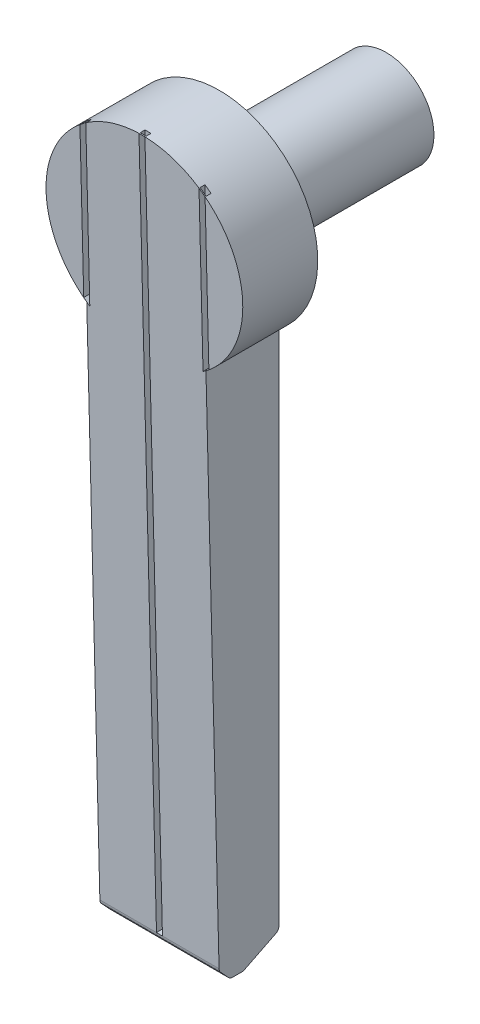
from build123d import *

# Parameters (mm, degrees)
EXTRUDE_1_DEPTH     = 13
SKETCH_2_R          = 8
EXTRUDE_2_DEPTH     = 28
CUT_EXTRUDE_4_DEPTH = 250
CUT_EXTRUDE_5_DEPTH = 72.317950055
FILLET_1_R          = 1
CUT_EXTRUDE_6_DEPTH = 1


with BuildPart() as part:
    # Sketch 1 → Extrude 1 (new body)
    with BuildSketch(Plane.XY):
        with BuildLine():
            Line((-10, -60), (10, -60))
            Line((10, -60), (10, 30.375595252))
            ThreePointArc((10, 30.375595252), (0, 60), (-10, 30.375595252))
            Line((-10, 30.375595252), (-10, -60))
        make_face()
    extrude(amount=EXTRUDE_1_DEPTH)

    # Sketch 2 → Extrude 2 (add)
    with BuildSketch(Plane(origin=(0, 0, 0), x_dir=(-1, 0, 0), z_dir=(0, 0, -1))):
        with Locations(Location((0, 43.5, 0), (0, 0, 180))):
            Circle(SKETCH_2_R)
    extrude(amount=EXTRUDE_2_DEPTH)

    # Sketch 5 → Cut-Extrude 4 (cut, symmetric)
    with BuildSketch(Plane.ZY.offset(10)):
        Polygon((13, 60), (10, -60), (13, -60), align=None)
    extrude(amount=CUT_EXTRUDE_4_DEPTH, both=True, mode=Mode.SUBTRACT)

    # Sketch 6 → Cut-Extrude 5 (cut, through all)
    with BuildSketch(Plane.ZY.offset(10)):
        Polygon((10.05, -58), (8.2, -60), (10, -60), align=None)
        Polygon((6, -60), (0, -57), (0, -60), align=None)
    extrude(amount=-CUT_EXTRUDE_5_DEPTH, mode=Mode.SUBTRACT)

    # Fillet 1
    fillet_1_edges = [part.edges().sort_by_distance(p)[0] for p in [
        (0, -58, 10.05),
        (0, -60, 8.2),
        (0, -60, 6),
        (0, -57, 0),
    ]]
    fillet(fillet_1_edges, radius=FILLET_1_R)

    # Sketch 7 → Cut-Extrude 6 (cut)
    with BuildSketch(Plane(origin=(0, -0.287320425, 11.492816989), x_dir=(1, 0, 0), z_dir=(0, -0.024992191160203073, 0.9996876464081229))):
        with BuildLine():
            Line((0.5, -57.353474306), (0.5, 60.293424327))
            ThreePointArc((0.5, 60.293424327), (0, 60.301001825), (-0.5, 60.293424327))
            Line((-0.5, 60.293424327), (-0.5, -57.353474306))
            Line((-0.5, -57.353474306), (0.5, -57.353474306))
        make_face()
        with BuildLine():
            Line((10.5, 31.073079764), (10.5, 56.528923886))
            ThreePointArc((10.5, 56.528923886), (10.00727095, 56.919863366), (9.5, 57.291739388))
            Line((9.5, 57.291739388), (9.5, 30.310264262))
            ThreePointArc((9.5, 30.310264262), (10.00727095, 30.682140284), (10.5, 31.073079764))
        make_face()
        with BuildLine():
            ThreePointArc((-9.5, 30.310264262), (-10.00727095, 30.682140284), (-10.5, 31.073079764))
            Line((-10.5, 31.073079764), (-10.5, 56.528923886))
            ThreePointArc((-10.5, 56.528923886), (-10.00727095, 56.919863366), (-9.5, 57.291739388))
            Line((-9.5, 57.291739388), (-9.5, 30.310264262))
        make_face()
    extrude(amount=-CUT_EXTRUDE_6_DEPTH, mode=Mode.SUBTRACT)


solid = part.part
